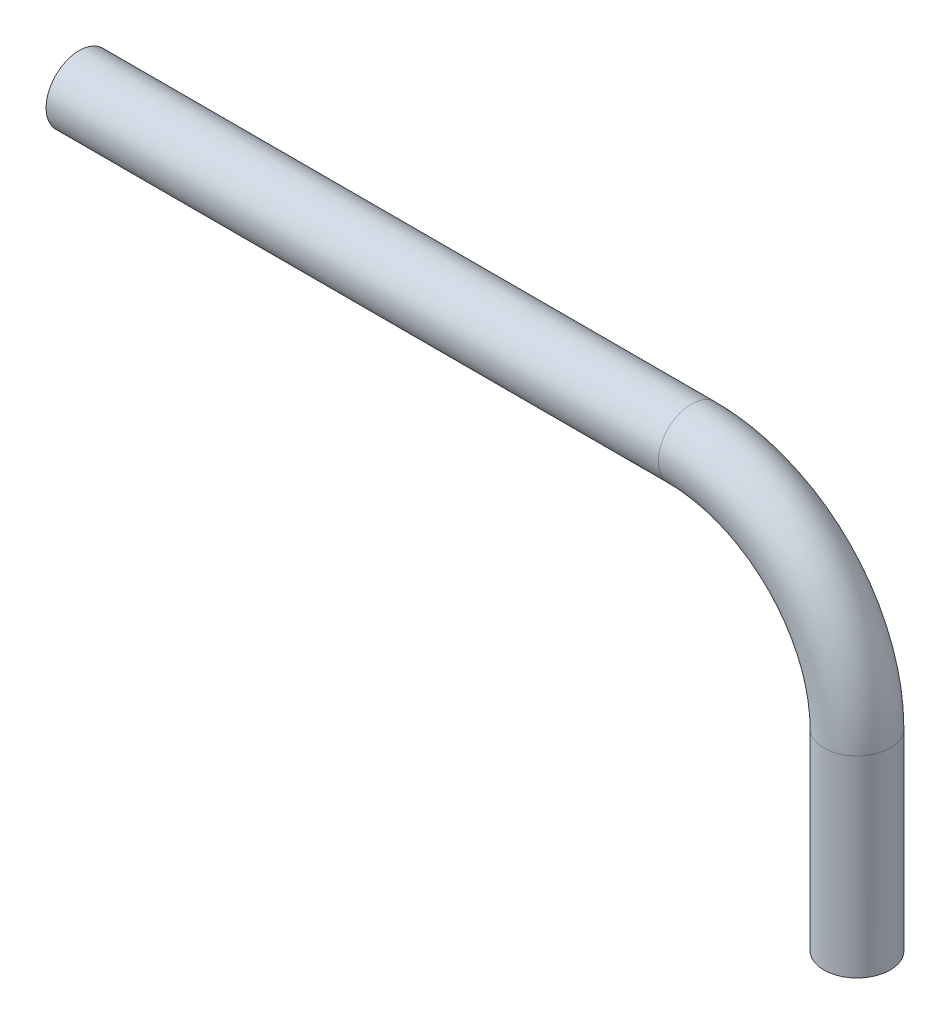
ISO-10303-21;
HEADER;
FILE_DESCRIPTION(('STEP AP214'),'2;1');
FILE_NAME('part.step','',(''),(''),'','','');
FILE_SCHEMA(('AUTOMOTIVE_DESIGN { 1 0 10303 214 1 1 1 1 }'));
ENDSEC;
DATA;
#1=APPLICATION_CONTEXT('core data for automotive mechanical design processes');
#2=APPLICATION_PROTOCOL_DEFINITION('international standard','automotive_design',2000,#1);
#3=PRODUCT_CONTEXT('',#1,'mechanical');
#4=PRODUCT('Part','Part','',(#3));
#5=PRODUCT_RELATED_PRODUCT_CATEGORY('part','',(#4));
#6=PRODUCT_DEFINITION_FORMATION('','',#4);
#7=PRODUCT_DEFINITION_CONTEXT('part definition',#1,'design');
#8=PRODUCT_DEFINITION('design','',#6,#7);
#9=PRODUCT_DEFINITION_SHAPE('','',#8);
#10=(LENGTH_UNIT() NAMED_UNIT(*) SI_UNIT(.MILLI.,.METRE.));
#11=(NAMED_UNIT(*) PLANE_ANGLE_UNIT() SI_UNIT($,.RADIAN.));
#12=(NAMED_UNIT(*) SI_UNIT($,.STERADIAN.) SOLID_ANGLE_UNIT());
#13=UNCERTAINTY_MEASURE_WITH_UNIT(LENGTH_MEASURE(1.E-05),#10,'distance_accuracy_value','');
#14=(GEOMETRIC_REPRESENTATION_CONTEXT(3) GLOBAL_UNCERTAINTY_ASSIGNED_CONTEXT((#13)) GLOBAL_UNIT_ASSIGNED_CONTEXT((#10,
#11,#12)) REPRESENTATION_CONTEXT('',''));
#15=CARTESIAN_POINT('',(0.,0.,0.));
#16=DIRECTION('',(0.,0.,1.));
#17=DIRECTION('',(1.,0.,0.));
#18=AXIS2_PLACEMENT_3D('',#15,#16,#17);
#19=CARTESIAN_POINT('',(0.,0.,0.));
#20=DIRECTION('',(0.,1.,0.));
#21=DIRECTION('',(-1.,0.,0.));
#22=AXIS2_PLACEMENT_3D('',#19,#20,#21);
#23=CYLINDRICAL_SURFACE('',#22,14.5);
#24=CARTESIAN_POINT('',(0.,100.,0.));
#25=DIRECTION('',(0.,1.,0.));
#26=DIRECTION('',(1.,0.,0.));
#27=AXIS2_PLACEMENT_3D('',#24,#25,#26);
#28=CIRCLE('',#27,14.5);
#29=CARTESIAN_POINT('',(14.5,100.,0.));
#30=VERTEX_POINT('',#29);
#31=EDGE_CURVE('E31',#30,#30,#28,.T.);
#32=ORIENTED_EDGE('',*,*,#31,.T.);
#33=EDGE_LOOP('',(#32));
#34=FACE_BOUND('',#33,.T.);
#35=CARTESIAN_POINT('',(0.,0.,0.));
#36=DIRECTION('',(0.,1.,0.));
#37=DIRECTION('',(-1.,0.,0.));
#38=AXIS2_PLACEMENT_3D('',#35,#36,#37);
#39=CIRCLE('',#38,14.5);
#40=CARTESIAN_POINT('',(-14.5,0.,0.));
#41=VERTEX_POINT('',#40);
#42=EDGE_CURVE('E18',#41,#41,#39,.F.);
#43=ORIENTED_EDGE('',*,*,#42,.T.);
#44=EDGE_LOOP('',(#43));
#45=FACE_BOUND('',#44,.T.);
#46=ADVANCED_FACE('F15',(#34,#45),#23,.F.);
#47=CARTESIAN_POINT('',(0.,0.,0.));
#48=DIRECTION('',(0.,1.,0.));
#49=DIRECTION('',(0.,0.,1.));
#50=AXIS2_PLACEMENT_3D('',#47,#48,#49);
#51=PLANE('',#50);
#52=CARTESIAN_POINT('',(0.,0.,0.));
#53=DIRECTION('',(0.,1.,0.));
#54=DIRECTION('',(-1.,0.,0.));
#55=AXIS2_PLACEMENT_3D('',#52,#53,#54);
#56=CIRCLE('',#55,17.25);
#57=CARTESIAN_POINT('',(-17.25,0.,0.));
#58=VERTEX_POINT('',#57);
#59=EDGE_CURVE('E35',#58,#58,#56,.T.);
#60=ORIENTED_EDGE('',*,*,#59,.F.);
#61=EDGE_LOOP('',(#60));
#62=FACE_BOUND('',#61,.T.);
#63=ORIENTED_EDGE('',*,*,#42,.F.);
#64=EDGE_LOOP('',(#63));
#65=FACE_BOUND('',#64,.T.);
#66=ADVANCED_FACE('F49',(#62,#65),#51,.F.);
#67=CARTESIAN_POINT('',(-86.0682546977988,100.,0.));
#68=DIRECTION('',(0.,0.,1.));
#69=DIRECTION('',(1.,0.,0.));
#70=AXIS2_PLACEMENT_3D('',#67,#68,#69);
#71=TOROIDAL_SURFACE('',#70,86.0682546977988,14.5);
#72=CARTESIAN_POINT('',(-86.0682546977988,186.068254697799,0.));
#73=DIRECTION('',(-1.,0.,0.));
#74=DIRECTION('',(0.,0.,1.));
#75=AXIS2_PLACEMENT_3D('',#72,#73,#74);
#76=CIRCLE('',#75,14.5);
#77=CARTESIAN_POINT('',(-86.0682546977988,186.068254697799,14.5));
#78=VERTEX_POINT('',#77);
#79=EDGE_CURVE('E37',#78,#78,#76,.T.);
#80=ORIENTED_EDGE('',*,*,#79,.T.);
#81=EDGE_LOOP('',(#80));
#82=FACE_BOUND('',#81,.T.);
#83=ORIENTED_EDGE('',*,*,#31,.F.);
#84=EDGE_LOOP('',(#83));
#85=FACE_BOUND('',#84,.T.);
#86=ADVANCED_FACE('F51',(#82,#85),#71,.F.);
#87=CARTESIAN_POINT('',(0.,0.,0.));
#88=DIRECTION('',(0.,1.,0.));
#89=DIRECTION('',(-1.,0.,0.));
#90=AXIS2_PLACEMENT_3D('',#87,#88,#89);
#91=CYLINDRICAL_SURFACE('',#90,17.25);
#92=ORIENTED_EDGE('',*,*,#59,.T.);
#93=EDGE_LOOP('',(#92));
#94=FACE_BOUND('',#93,.T.);
#95=CARTESIAN_POINT('',(0.,100.,0.));
#96=DIRECTION('',(0.,1.,0.));
#97=DIRECTION('',(1.,0.,0.));
#98=AXIS2_PLACEMENT_3D('',#95,#96,#97);
#99=CIRCLE('',#98,17.25);
#100=CARTESIAN_POINT('',(17.25,100.,0.));
#101=VERTEX_POINT('',#100);
#102=EDGE_CURVE('E34',#101,#101,#99,.T.);
#103=ORIENTED_EDGE('',*,*,#102,.F.);
#104=EDGE_LOOP('',(#103));
#105=FACE_BOUND('',#104,.T.);
#106=ADVANCED_FACE('F58',(#94,#105),#91,.T.);
#107=CARTESIAN_POINT('',(-86.0682546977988,186.068254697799,0.));
#108=DIRECTION('',(-1.,0.,0.));
#109=DIRECTION('',(0.,0.,1.));
#110=AXIS2_PLACEMENT_3D('',#107,#108,#109);
#111=CYLINDRICAL_SURFACE('',#110,14.5);
#112=ORIENTED_EDGE('',*,*,#79,.F.);
#113=EDGE_LOOP('',(#112));
#114=FACE_BOUND('',#113,.T.);
#115=CARTESIAN_POINT('',(-404.5,186.068254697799,0.));
#116=DIRECTION('',(-1.,0.,0.));
#117=DIRECTION('',(0.,0.,1.));
#118=AXIS2_PLACEMENT_3D('',#115,#116,#117);
#119=CIRCLE('',#118,14.5);
#120=CARTESIAN_POINT('',(-404.5,186.068254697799,14.5));
#121=VERTEX_POINT('',#120);
#122=EDGE_CURVE('E27',#121,#121,#119,.F.);
#123=ORIENTED_EDGE('',*,*,#122,.F.);
#124=EDGE_LOOP('',(#123));
#125=FACE_BOUND('',#124,.T.);
#126=ADVANCED_FACE('F76',(#114,#125),#111,.F.);
#127=CARTESIAN_POINT('',(-86.0682546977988,100.,0.));
#128=DIRECTION('',(0.,0.,1.));
#129=DIRECTION('',(1.,0.,0.));
#130=AXIS2_PLACEMENT_3D('',#127,#128,#129);
#131=TOROIDAL_SURFACE('',#130,86.0682546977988,17.25);
#132=ORIENTED_EDGE('',*,*,#102,.T.);
#133=EDGE_LOOP('',(#132));
#134=FACE_BOUND('',#133,.T.);
#135=CARTESIAN_POINT('',(-86.0682546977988,186.068254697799,0.));
#136=DIRECTION('',(-1.,0.,0.));
#137=DIRECTION('',(0.,0.,1.));
#138=AXIS2_PLACEMENT_3D('',#135,#136,#137);
#139=CIRCLE('',#138,17.25);
#140=CARTESIAN_POINT('',(-86.0682546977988,186.068254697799,17.25));
#141=VERTEX_POINT('',#140);
#142=EDGE_CURVE('E22',#141,#141,#139,.T.);
#143=ORIENTED_EDGE('',*,*,#142,.F.);
#144=EDGE_LOOP('',(#143));
#145=FACE_BOUND('',#144,.T.);
#146=ADVANCED_FACE('F68',(#134,#145),#131,.T.);
#147=CARTESIAN_POINT('',(-404.5,186.068254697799,0.));
#148=DIRECTION('',(-1.,0.,0.));
#149=DIRECTION('',(0.,-1.,0.));
#150=AXIS2_PLACEMENT_3D('',#147,#148,#149);
#151=PLANE('',#150);
#152=CARTESIAN_POINT('',(-404.5,186.068254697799,0.));
#153=DIRECTION('',(-1.,0.,0.));
#154=DIRECTION('',(0.,0.,1.));
#155=AXIS2_PLACEMENT_3D('',#152,#153,#154);
#156=CIRCLE('',#155,17.25);
#157=CARTESIAN_POINT('',(-404.5,186.068254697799,17.25));
#158=VERTEX_POINT('',#157);
#159=EDGE_CURVE('E10',#158,#158,#156,.F.);
#160=ORIENTED_EDGE('',*,*,#159,.F.);
#161=EDGE_LOOP('',(#160));
#162=FACE_BOUND('',#161,.T.);
#163=ORIENTED_EDGE('',*,*,#122,.T.);
#164=EDGE_LOOP('',(#163));
#165=FACE_BOUND('',#164,.T.);
#166=ADVANCED_FACE('F63',(#162,#165),#151,.T.);
#167=CARTESIAN_POINT('',(-86.0682546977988,186.068254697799,0.));
#168=DIRECTION('',(-1.,0.,0.));
#169=DIRECTION('',(0.,0.,1.));
#170=AXIS2_PLACEMENT_3D('',#167,#168,#169);
#171=CYLINDRICAL_SURFACE('',#170,17.25);
#172=ORIENTED_EDGE('',*,*,#159,.T.);
#173=EDGE_LOOP('',(#172));
#174=FACE_BOUND('',#173,.T.);
#175=ORIENTED_EDGE('',*,*,#142,.T.);
#176=EDGE_LOOP('',(#175));
#177=FACE_BOUND('',#176,.T.);
#178=ADVANCED_FACE('F61',(#174,#177),#171,.T.);
#179=CLOSED_SHELL('',(#46,#66,#86,#106,#126,#146,#166,#178));
#180=MANIFOLD_SOLID_BREP('B1',#179);
#181=ADVANCED_BREP_SHAPE_REPRESENTATION('',(#18,#180),#14);
#182=SHAPE_DEFINITION_REPRESENTATION(#9,#181);
ENDSEC;
END-ISO-10303-21;
